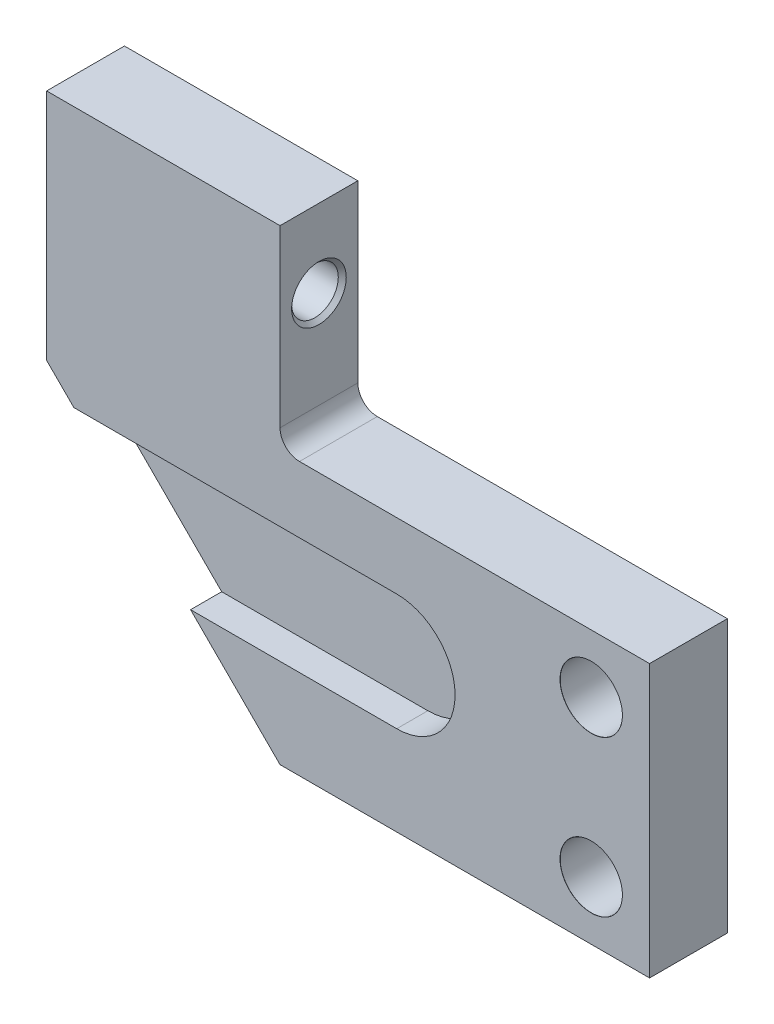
from build123d import *

# Parameters (mm, degrees)
AUFSATZ_LINEAR_AUSTRAGEN1_DEPTH           = 20
SCHNITT_LINEAR_AUSTRAGEN1_DEPTH           = 8
F_16_0_16_DURCHMESSER_BOHRUNG6_AT_2_COUNT = 2
F_16_0_16_DURCHMESSER_BOHRUNG6_AT_2_PITCH = 40


with BuildPart() as part:
    # Skizze1 → Aufsatz-Linear austragen1 (new body)
    with BuildSketch(Plane.XY):
        with BuildLine():
            Line((0, 120), (0, 60))
            Line((0, 60), (60, 0))
            Line((60, 0), (155, 0))
            Line((155, 0), (155, 70))
            Line((155, 70), (65, 70))
            ThreePointArc((65, 70), (61.464466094, 71.464466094), (60, 75))
            Line((60, 75), (60, 120))
            Line((60, 120), (0, 120))
        make_face()
    extrude(amount=AUFSATZ_LINEAR_AUSTRAGEN1_DEPTH)

    # Skizze2 → Schnitt-Linear austragen1 (cut)
    with BuildSketch(Plane.XY.offset(20)):
        with BuildLine():
            Line((7, 53), (90, 53))
            ThreePointArc((90, 53), (105, 38), (90, 23))
            Line((90, 23), (37, 23))
            Line((37, 23), (7, 53))
        make_face()
    extrude(amount=-SCHNITT_LINEAR_AUSTRAGEN1_DEPTH, mode=Mode.SUBTRACT)

    # Skizze31 → 16.0 _16_ Durchmesser Bohrung6 (revolve, cut)
    with BuildSketch(Plane(origin=(140, 55, 20), x_dir=(0, -1, 0), z_dir=(1, 0, 0))):
        Polygon((0, 0), (0, 20), (8.025, 20), (8, 19.975), (8, 0.025), (8.025, 0), align=None)
    f_16_0_16_durchmesser_bohrung6 = revolve(axis=Axis((140, 55, 26.35), (0, 0, -1)), mode=Mode.SUBTRACT)

    # 16.0 _16_ Durchmesser Bohrung6 at 2: 16.0 _16_ Durchmesser Bohrung6 ×2
    with Locations(*[(0, -i * F_16_0_16_DURCHMESSER_BOHRUNG6_AT_2_PITCH, 0) for i in range(1, F_16_0_16_DURCHMESSER_BOHRUNG6_AT_2_COUNT)]):
        add(f_16_0_16_durchmesser_bohrung6, mode=Mode.SUBTRACT)

    # Skizze35 → M14 Gewindebohrung2 (revolve, cut)
    with BuildSketch(Plane(origin=(60, 100, 10), x_dir=(0, 0, -1), z_dir=(0, 1, 0))):
        Polygon((0, 0), (0, 60), (7.025, 60), (6, 58.975), (6, 1.025), (7.025, 0), align=None)
    revolve(axis=Axis((66.35, 100, 10), (-1, 0, 0)), mode=Mode.SUBTRACT)


solid = part.part
